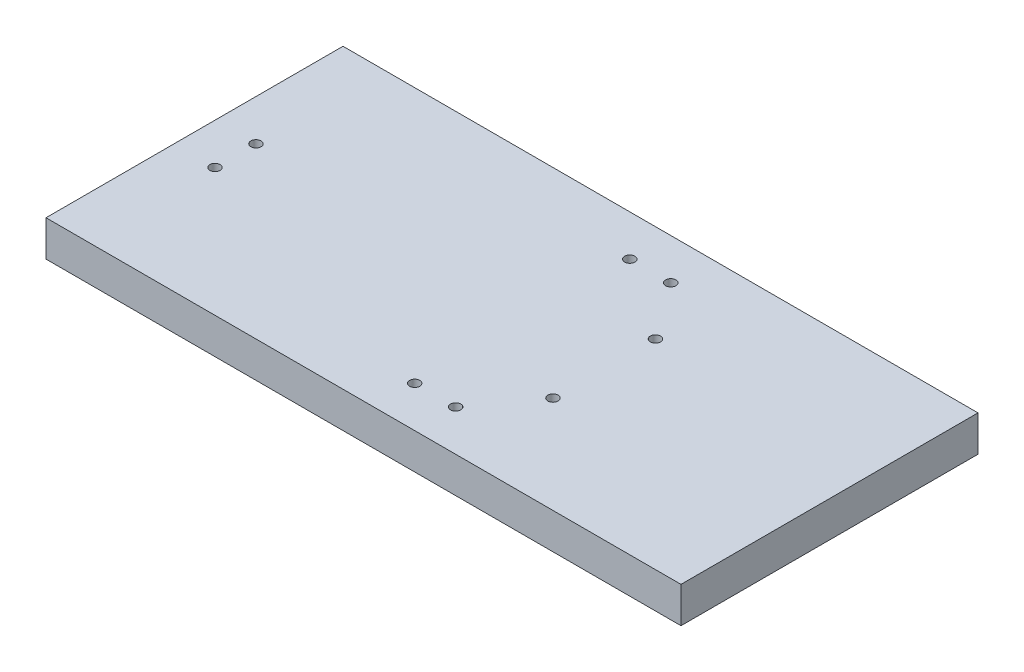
from build123d import *

# Parameters (mm, degrees)
SKETCH1_W      = 98.425
SKETCH1_H      = 46.0375
SKETCH1_R      = 0.79375
EXTRUDE1_DEPTH = 5.55625


with BuildPart() as part:
    # Sketch1 → Extrude1 (new body)
    with BuildSketch(Plane(origin=(0, 0, 0), x_dir=(1, 0, 0), z_dir=(0, 1, 0))):
        with Locations((9.989838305, -14.900833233)):
            Rectangle(SKETCH1_W, SKETCH1_H)
        with Locations(Location((11.577338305, -31.569583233, 0), (0, 0, 270))):
            Circle(SKETCH1_R, mode=Mode.SUBTRACT)
        with Locations(Location((17.927338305, -31.569583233, 0), (0, 0, 270))):
            Circle(SKETCH1_R, mode=Mode.SUBTRACT)
        with Locations(Location((11.577338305, 1.767916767, 0), (0, 0, 270))):
            Circle(SKETCH1_R, mode=Mode.SUBTRACT)
        with Locations(Location((17.927338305, 1.767916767, 0), (0, 0, 270))):
            Circle(SKETCH1_R, mode=Mode.SUBTRACT)
        with Locations(Location((-32.872661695, -11.725833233, 0), (0, 0, 270))):
            Circle(SKETCH1_R, mode=Mode.SUBTRACT)
        with Locations(Location((24.277338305, -22.838333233, 0), (0, 0, 90))):
            Circle(SKETCH1_R, mode=Mode.SUBTRACT)
        with Locations(Location((24.277338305, -6.963333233, 0), (0, 0, 270))):
            Circle(SKETCH1_R, mode=Mode.SUBTRACT)
        with Locations(Location((-32.872661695, -18.075833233, 0), (0, 0, 90))):
            Circle(SKETCH1_R, mode=Mode.SUBTRACT)
    extrude(amount=EXTRUDE1_DEPTH)


solid = part.part
